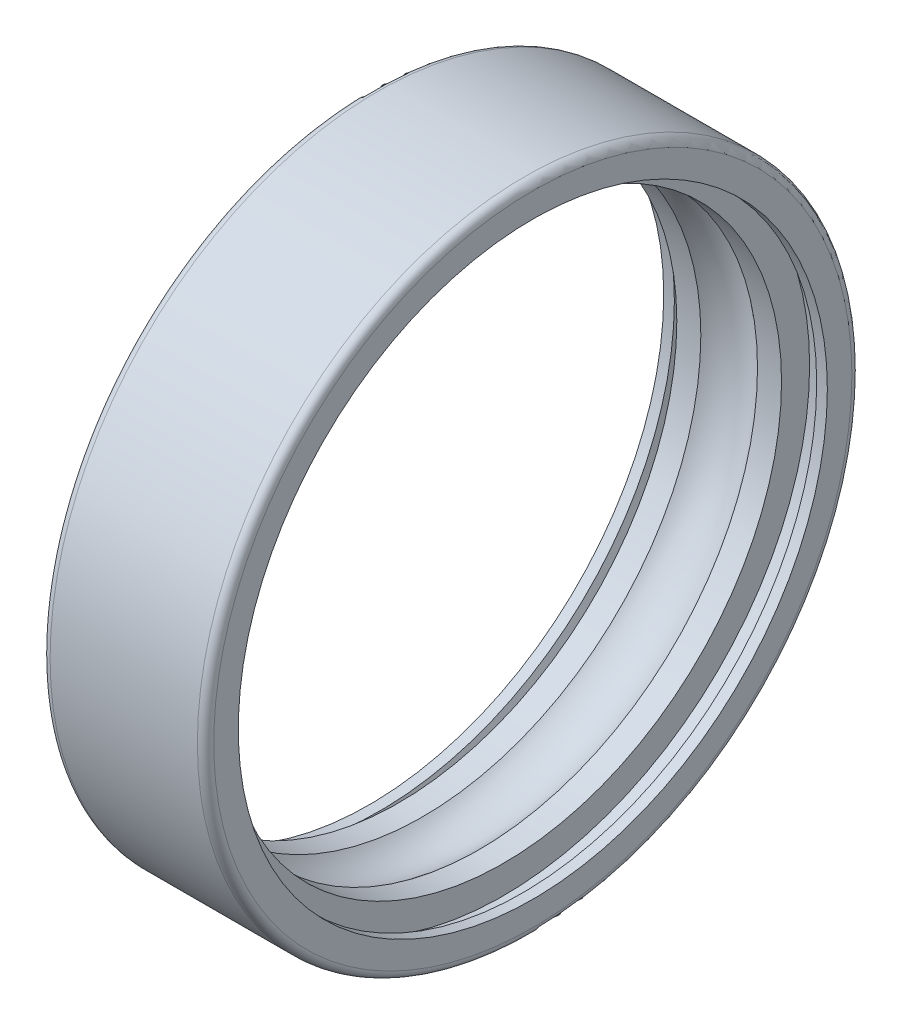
ISO-10303-21;
HEADER;
FILE_DESCRIPTION(('STEP AP214'),'2;1');
FILE_NAME('part.step','',(''),(''),'','','');
FILE_SCHEMA(('AUTOMOTIVE_DESIGN { 1 0 10303 214 1 1 1 1 }'));
ENDSEC;
DATA;
#1=APPLICATION_CONTEXT('core data for automotive mechanical design processes');
#2=APPLICATION_PROTOCOL_DEFINITION('international standard','automotive_design',2000,#1);
#3=PRODUCT_CONTEXT('',#1,'mechanical');
#4=PRODUCT('Part','Part','',(#3));
#5=PRODUCT_RELATED_PRODUCT_CATEGORY('part','',(#4));
#6=PRODUCT_DEFINITION_FORMATION('','',#4);
#7=PRODUCT_DEFINITION_CONTEXT('part definition',#1,'design');
#8=PRODUCT_DEFINITION('design','',#6,#7);
#9=PRODUCT_DEFINITION_SHAPE('','',#8);
#10=(LENGTH_UNIT() NAMED_UNIT(*) SI_UNIT(.MILLI.,.METRE.));
#11=(NAMED_UNIT(*) PLANE_ANGLE_UNIT() SI_UNIT($,.RADIAN.));
#12=(NAMED_UNIT(*) SI_UNIT($,.STERADIAN.) SOLID_ANGLE_UNIT());
#13=UNCERTAINTY_MEASURE_WITH_UNIT(LENGTH_MEASURE(1.E-05),#10,'distance_accuracy_value','');
#14=(GEOMETRIC_REPRESENTATION_CONTEXT(3) GLOBAL_UNCERTAINTY_ASSIGNED_CONTEXT((#13)) GLOBAL_UNIT_ASSIGNED_CONTEXT((#10,
#11,#12)) REPRESENTATION_CONTEXT('',''));
#15=CARTESIAN_POINT('',(0.,0.,0.));
#16=DIRECTION('',(0.,0.,1.));
#17=DIRECTION('',(1.,0.,0.));
#18=AXIS2_PLACEMENT_3D('',#15,#16,#17);
#19=CARTESIAN_POINT('',(0.,11.7,0.));
#20=DIRECTION('',(-1.,0.,0.));
#21=DIRECTION('',(0.,0.,1.));
#22=AXIS2_PLACEMENT_3D('',#19,#20,#21);
#23=PLANE('',#22);
#24=CARTESIAN_POINT('',(0.,0.,0.));
#25=DIRECTION('',(1.,0.,0.));
#26=DIRECTION('',(0.,0.,-1.));
#27=AXIS2_PLACEMENT_3D('',#24,#25,#26);
#28=CIRCLE('',#27,10.8);
#29=CARTESIAN_POINT('',(0.,0.,-10.8));
#30=VERTEX_POINT('',#29);
#31=EDGE_CURVE('E67',#30,#30,#28,.T.);
#32=ORIENTED_EDGE('',*,*,#31,.T.);
#33=EDGE_LOOP('',(#32));
#34=FACE_BOUND('',#33,.T.);
#35=CARTESIAN_POINT('',(0.,0.,0.));
#36=DIRECTION('',(1.,0.,0.));
#37=DIRECTION('',(0.,0.,-1.));
#38=AXIS2_PLACEMENT_3D('',#35,#36,#37);
#39=CIRCLE('',#38,11.7000000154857);
#40=CARTESIAN_POINT('',(0.,0.,-11.7000000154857));
#41=VERTEX_POINT('',#40);
#42=EDGE_CURVE('E64',#41,#41,#39,.T.);
#43=ORIENTED_EDGE('',*,*,#42,.F.);
#44=EDGE_LOOP('',(#43));
#45=FACE_BOUND('',#44,.T.);
#46=ADVANCED_FACE('F14',(#34,#45),#23,.T.);
#47=CARTESIAN_POINT('',(6.,0.,0.));
#48=DIRECTION('',(1.,0.,0.));
#49=DIRECTION('',(0.,0.,-1.));
#50=AXIS2_PLACEMENT_3D('',#47,#48,#49);
#51=CYLINDRICAL_SURFACE('',#50,10.8);
#52=CARTESIAN_POINT('',(0.39060981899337,0.,0.));
#53=DIRECTION('',(1.,0.,0.));
#54=DIRECTION('',(0.,0.,-1.));
#55=AXIS2_PLACEMENT_3D('',#52,#53,#54);
#56=CIRCLE('',#55,10.8);
#57=CARTESIAN_POINT('',(0.39060981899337,0.,-10.8));
#58=VERTEX_POINT('',#57);
#59=EDGE_CURVE('E61',#58,#58,#56,.T.);
#60=ORIENTED_EDGE('',*,*,#59,.T.);
#61=EDGE_LOOP('',(#60));
#62=FACE_BOUND('',#61,.T.);
#63=ORIENTED_EDGE('',*,*,#31,.F.);
#64=EDGE_LOOP('',(#63));
#65=FACE_BOUND('',#64,.T.);
#66=ADVANCED_FACE('F73',(#62,#65),#51,.F.);
#67=CARTESIAN_POINT('',(0.39060981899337,0.,0.));
#68=DIRECTION('',(1.,0.,0.));
#69=DIRECTION('',(0.,0.,-1.));
#70=AXIS2_PLACEMENT_3D('',#67,#68,#69);
#71=CONICAL_SURFACE('',#70,10.8,1.14109666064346);
#72=CARTESIAN_POINT('',(0.58747727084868,0.,0.));
#73=DIRECTION('',(1.,0.,0.));
#74=DIRECTION('',(0.,0.,-1.));
#75=AXIS2_PLACEMENT_3D('',#72,#73,#74);
#76=CIRCLE('',#75,11.2296);
#77=CARTESIAN_POINT('',(0.58747727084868,0.,-11.2296));
#78=VERTEX_POINT('',#77);
#79=EDGE_CURVE('E58',#78,#78,#76,.T.);
#80=ORIENTED_EDGE('',*,*,#79,.T.);
#81=EDGE_LOOP('',(#80));
#82=FACE_BOUND('',#81,.T.);
#83=ORIENTED_EDGE('',*,*,#59,.F.);
#84=EDGE_LOOP('',(#83));
#85=FACE_BOUND('',#84,.T.);
#86=ADVANCED_FACE('F75',(#82,#85),#71,.F.);
#87=CARTESIAN_POINT('',(6.,0.,0.));
#88=DIRECTION('',(1.,0.,0.));
#89=DIRECTION('',(0.,0.,-1.));
#90=AXIS2_PLACEMENT_3D('',#87,#88,#89);
#91=CYLINDRICAL_SURFACE('',#90,11.2296);
#92=CARTESIAN_POINT('',(1.08,0.,0.));
#93=DIRECTION('',(1.,0.,0.));
#94=DIRECTION('',(0.,0.,-1.));
#95=AXIS2_PLACEMENT_3D('',#92,#93,#94);
#96=CIRCLE('',#95,11.2296);
#97=CARTESIAN_POINT('',(1.08,0.,-11.2296));
#98=VERTEX_POINT('',#97);
#99=EDGE_CURVE('E55',#98,#98,#96,.T.);
#100=ORIENTED_EDGE('',*,*,#99,.T.);
#101=EDGE_LOOP('',(#100));
#102=FACE_BOUND('',#101,.T.);
#103=ORIENTED_EDGE('',*,*,#79,.F.);
#104=EDGE_LOOP('',(#103));
#105=FACE_BOUND('',#104,.T.);
#106=ADVANCED_FACE('F83',(#102,#105),#91,.F.);
#107=CARTESIAN_POINT('',(1.08,11.2296,0.));
#108=DIRECTION('',(-1.,0.,0.));
#109=DIRECTION('',(0.,0.,1.));
#110=AXIS2_PLACEMENT_3D('',#107,#108,#109);
#111=PLANE('',#110);
#112=CARTESIAN_POINT('',(1.08,0.,0.));
#113=DIRECTION('',(1.,0.,0.));
#114=DIRECTION('',(0.,0.,-1.));
#115=AXIS2_PLACEMENT_3D('',#112,#113,#114);
#116=CIRCLE('',#115,10.2);
#117=CARTESIAN_POINT('',(1.08,0.,-10.2));
#118=VERTEX_POINT('',#117);
#119=EDGE_CURVE('E52',#118,#118,#116,.T.);
#120=ORIENTED_EDGE('',*,*,#119,.T.);
#121=EDGE_LOOP('',(#120));
#122=FACE_BOUND('',#121,.T.);
#123=ORIENTED_EDGE('',*,*,#99,.F.);
#124=EDGE_LOOP('',(#123));
#125=FACE_BOUND('',#124,.T.);
#126=ADVANCED_FACE('F90',(#122,#125),#111,.T.);
#127=CARTESIAN_POINT('',(6.,0.,0.));
#128=DIRECTION('',(1.,0.,0.));
#129=DIRECTION('',(0.,0.,-1.));
#130=AXIS2_PLACEMENT_3D('',#127,#128,#129);
#131=CYLINDRICAL_SURFACE('',#130,10.2);
#132=CARTESIAN_POINT('',(1.9606943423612,0.,0.));
#133=DIRECTION('',(1.,0.,0.));
#134=DIRECTION('',(0.,0.,-1.));
#135=AXIS2_PLACEMENT_3D('',#132,#133,#134);
#136=CIRCLE('',#135,10.2);
#137=CARTESIAN_POINT('',(1.9606943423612,0.,-10.2));
#138=VERTEX_POINT('',#137);
#139=EDGE_CURVE('E49',#138,#138,#136,.T.);
#140=ORIENTED_EDGE('',*,*,#139,.T.);
#141=EDGE_LOOP('',(#140));
#142=FACE_BOUND('',#141,.T.);
#143=ORIENTED_EDGE('',*,*,#119,.F.);
#144=EDGE_LOOP('',(#143));
#145=FACE_BOUND('',#144,.T.);
#146=ADVANCED_FACE('F94',(#142,#145),#131,.F.);
#147=CARTESIAN_POINT('',(3.,0.,0.));
#148=DIRECTION('',(1.,0.,0.));
#149=DIRECTION('',(0.,0.,-1.));
#150=AXIS2_PLACEMENT_3D('',#147,#148,#149);
#151=TOROIDAL_SURFACE('',#150,9.,1.5875);
#152=ORIENTED_EDGE('',*,*,#139,.F.);
#153=EDGE_LOOP('',(#152));
#154=FACE_BOUND('',#153,.T.);
#155=CARTESIAN_POINT('',(4.0393056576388,0.,0.));
#156=DIRECTION('',(1.,0.,0.));
#157=DIRECTION('',(0.,0.,-1.));
#158=AXIS2_PLACEMENT_3D('',#155,#156,#157);
#159=CIRCLE('',#158,10.2);
#160=CARTESIAN_POINT('',(4.0393056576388,0.,-10.2));
#161=VERTEX_POINT('',#160);
#162=EDGE_CURVE('E46',#161,#161,#159,.T.);
#163=ORIENTED_EDGE('',*,*,#162,.T.);
#164=EDGE_LOOP('',(#163));
#165=FACE_BOUND('',#164,.T.);
#166=ADVANCED_FACE('F98',(#154,#165),#151,.F.);
#167=CARTESIAN_POINT('',(6.,0.,0.));
#168=DIRECTION('',(1.,0.,0.));
#169=DIRECTION('',(0.,0.,-1.));
#170=AXIS2_PLACEMENT_3D('',#167,#168,#169);
#171=CYLINDRICAL_SURFACE('',#170,10.2);
#172=CARTESIAN_POINT('',(4.92,0.,0.));
#173=DIRECTION('',(1.,0.,0.));
#174=DIRECTION('',(0.,0.,-1.));
#175=AXIS2_PLACEMENT_3D('',#172,#173,#174);
#176=CIRCLE('',#175,10.2);
#177=CARTESIAN_POINT('',(4.92,0.,-10.2));
#178=VERTEX_POINT('',#177);
#179=EDGE_CURVE('E43',#178,#178,#176,.T.);
#180=ORIENTED_EDGE('',*,*,#179,.T.);
#181=EDGE_LOOP('',(#180));
#182=FACE_BOUND('',#181,.T.);
#183=ORIENTED_EDGE('',*,*,#162,.F.);
#184=EDGE_LOOP('',(#183));
#185=FACE_BOUND('',#184,.T.);
#186=ADVANCED_FACE('F102',(#182,#185),#171,.F.);
#187=CARTESIAN_POINT('',(4.92,10.2,0.));
#188=DIRECTION('',(1.,0.,0.));
#189=DIRECTION('',(0.,0.,-1.));
#190=AXIS2_PLACEMENT_3D('',#187,#188,#189);
#191=PLANE('',#190);
#192=CARTESIAN_POINT('',(4.92,0.,0.));
#193=DIRECTION('',(1.,0.,0.));
#194=DIRECTION('',(0.,0.,-1.));
#195=AXIS2_PLACEMENT_3D('',#192,#193,#194);
#196=CIRCLE('',#195,11.2296);
#197=CARTESIAN_POINT('',(4.92,0.,-11.2296));
#198=VERTEX_POINT('',#197);
#199=EDGE_CURVE('E40',#198,#198,#196,.T.);
#200=ORIENTED_EDGE('',*,*,#199,.T.);
#201=EDGE_LOOP('',(#200));
#202=FACE_BOUND('',#201,.T.);
#203=ORIENTED_EDGE('',*,*,#179,.F.);
#204=EDGE_LOOP('',(#203));
#205=FACE_BOUND('',#204,.T.);
#206=ADVANCED_FACE('F106',(#202,#205),#191,.T.);
#207=CARTESIAN_POINT('',(6.,0.,0.));
#208=DIRECTION('',(1.,0.,0.));
#209=DIRECTION('',(0.,0.,-1.));
#210=AXIS2_PLACEMENT_3D('',#207,#208,#209);
#211=CYLINDRICAL_SURFACE('',#210,11.2296);
#212=CARTESIAN_POINT('',(5.4125227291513,0.,0.));
#213=DIRECTION('',(1.,0.,0.));
#214=DIRECTION('',(0.,0.,-1.));
#215=AXIS2_PLACEMENT_3D('',#212,#213,#214);
#216=CIRCLE('',#215,11.2296);
#217=CARTESIAN_POINT('',(5.4125227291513,0.,-11.2296));
#218=VERTEX_POINT('',#217);
#219=EDGE_CURVE('E37',#218,#218,#216,.T.);
#220=ORIENTED_EDGE('',*,*,#219,.T.);
#221=EDGE_LOOP('',(#220));
#222=FACE_BOUND('',#221,.T.);
#223=ORIENTED_EDGE('',*,*,#199,.F.);
#224=EDGE_LOOP('',(#223));
#225=FACE_BOUND('',#224,.T.);
#226=ADVANCED_FACE('F110',(#222,#225),#211,.F.);
#227=CARTESIAN_POINT('',(5.4125227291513,0.,0.));
#228=DIRECTION('',(-1.,0.,0.));
#229=DIRECTION('',(0.,0.,1.));
#230=AXIS2_PLACEMENT_3D('',#227,#228,#229);
#231=CONICAL_SURFACE('',#230,11.2296,1.14109666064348);
#232=CARTESIAN_POINT('',(5.6093901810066,0.,0.));
#233=DIRECTION('',(1.,0.,0.));
#234=DIRECTION('',(0.,0.,-1.));
#235=AXIS2_PLACEMENT_3D('',#232,#233,#234);
#236=CIRCLE('',#235,10.8);
#237=CARTESIAN_POINT('',(5.6093901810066,0.,-10.8));
#238=VERTEX_POINT('',#237);
#239=EDGE_CURVE('E34',#238,#238,#236,.T.);
#240=ORIENTED_EDGE('',*,*,#239,.T.);
#241=EDGE_LOOP('',(#240));
#242=FACE_BOUND('',#241,.T.);
#243=ORIENTED_EDGE('',*,*,#219,.F.);
#244=EDGE_LOOP('',(#243));
#245=FACE_BOUND('',#244,.T.);
#246=ADVANCED_FACE('F114',(#242,#245),#231,.F.);
#247=CARTESIAN_POINT('',(6.,0.,0.));
#248=DIRECTION('',(1.,0.,0.));
#249=DIRECTION('',(0.,0.,-1.));
#250=AXIS2_PLACEMENT_3D('',#247,#248,#249);
#251=CYLINDRICAL_SURFACE('',#250,10.8);
#252=CARTESIAN_POINT('',(6.,0.,0.));
#253=DIRECTION('',(1.,0.,0.));
#254=DIRECTION('',(0.,0.,-1.));
#255=AXIS2_PLACEMENT_3D('',#252,#253,#254);
#256=CIRCLE('',#255,10.8);
#257=CARTESIAN_POINT('',(6.,0.,-10.8));
#258=VERTEX_POINT('',#257);
#259=EDGE_CURVE('E29',#258,#258,#256,.T.);
#260=ORIENTED_EDGE('',*,*,#259,.T.);
#261=EDGE_LOOP('',(#260));
#262=FACE_BOUND('',#261,.T.);
#263=ORIENTED_EDGE('',*,*,#239,.F.);
#264=EDGE_LOOP('',(#263));
#265=FACE_BOUND('',#264,.T.);
#266=ADVANCED_FACE('F118',(#262,#265),#251,.F.);
#267=CARTESIAN_POINT('',(6.,10.8,0.));
#268=DIRECTION('',(1.,0.,0.));
#269=DIRECTION('',(0.,0.,-1.));
#270=AXIS2_PLACEMENT_3D('',#267,#268,#269);
#271=PLANE('',#270);
#272=CARTESIAN_POINT('',(6.,0.,0.));
#273=DIRECTION('',(1.,0.,0.));
#274=DIRECTION('',(0.,0.,-1.));
#275=AXIS2_PLACEMENT_3D('',#272,#273,#274);
#276=CIRCLE('',#275,11.6999999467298);
#277=CARTESIAN_POINT('',(6.,0.,-11.6999999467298));
#278=VERTEX_POINT('',#277);
#279=EDGE_CURVE('E25',#278,#278,#276,.T.);
#280=ORIENTED_EDGE('',*,*,#279,.T.);
#281=EDGE_LOOP('',(#280));
#282=FACE_BOUND('',#281,.T.);
#283=ORIENTED_EDGE('',*,*,#259,.F.);
#284=EDGE_LOOP('',(#283));
#285=FACE_BOUND('',#284,.T.);
#286=ADVANCED_FACE('F122',(#282,#285),#271,.T.);
#287=CARTESIAN_POINT('',(5.70000000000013,0.,0.));
#288=DIRECTION('',(1.,0.,0.));
#289=DIRECTION('',(0.,0.,-1.));
#290=AXIS2_PLACEMENT_3D('',#287,#288,#289);
#291=TOROIDAL_SURFACE('',#290,11.7000000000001,0.299999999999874);
#292=CARTESIAN_POINT('',(5.7,0.,0.));
#293=DIRECTION('',(1.,0.,0.));
#294=DIRECTION('',(0.,0.,-1.));
#295=AXIS2_PLACEMENT_3D('',#292,#293,#294);
#296=CIRCLE('',#295,12.);
#297=CARTESIAN_POINT('',(5.7,0.,-12.));
#298=VERTEX_POINT('',#297);
#299=EDGE_CURVE('E21',#298,#298,#296,.T.);
#300=ORIENTED_EDGE('',*,*,#299,.T.);
#301=EDGE_LOOP('',(#300));
#302=FACE_BOUND('',#301,.T.);
#303=ORIENTED_EDGE('',*,*,#279,.F.);
#304=EDGE_LOOP('',(#303));
#305=FACE_BOUND('',#304,.T.);
#306=ADVANCED_FACE('F126',(#302,#305),#291,.T.);
#307=CARTESIAN_POINT('',(6.,0.,0.));
#308=DIRECTION('',(1.,0.,0.));
#309=DIRECTION('',(0.,0.,-1.));
#310=AXIS2_PLACEMENT_3D('',#307,#308,#309);
#311=CYLINDRICAL_SURFACE('',#310,12.);
#312=CARTESIAN_POINT('',(0.3,0.,0.));
#313=DIRECTION('',(1.,0.,0.));
#314=DIRECTION('',(0.,0.,-1.));
#315=AXIS2_PLACEMENT_3D('',#312,#313,#314);
#316=CIRCLE('',#315,12.);
#317=CARTESIAN_POINT('',(0.3,0.,-12.));
#318=VERTEX_POINT('',#317);
#319=EDGE_CURVE('E10',#318,#318,#316,.T.);
#320=ORIENTED_EDGE('',*,*,#319,.T.);
#321=EDGE_LOOP('',(#320));
#322=FACE_BOUND('',#321,.T.);
#323=ORIENTED_EDGE('',*,*,#299,.F.);
#324=EDGE_LOOP('',(#323));
#325=FACE_BOUND('',#324,.T.);
#326=ADVANCED_FACE('F129',(#322,#325),#311,.T.);
#327=CARTESIAN_POINT('',(0.299999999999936,0.,0.));
#328=DIRECTION('',(1.,0.,0.));
#329=DIRECTION('',(0.,0.,-1.));
#330=AXIS2_PLACEMENT_3D('',#327,#328,#329);
#331=TOROIDAL_SURFACE('',#330,11.7,0.299999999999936);
#332=ORIENTED_EDGE('',*,*,#42,.T.);
#333=EDGE_LOOP('',(#332));
#334=FACE_BOUND('',#333,.T.);
#335=ORIENTED_EDGE('',*,*,#319,.F.);
#336=EDGE_LOOP('',(#335));
#337=FACE_BOUND('',#336,.T.);
#338=ADVANCED_FACE('F16',(#334,#337),#331,.T.);
#339=CLOSED_SHELL('',(#46,#66,#86,#106,#126,#146,#166,#186,#206,#226,#246,#266,#286,#306,#326,#338));
#340=MANIFOLD_SOLID_BREP('B1',#339);
#341=ADVANCED_BREP_SHAPE_REPRESENTATION('',(#18,#340),#14);
#342=SHAPE_DEFINITION_REPRESENTATION(#9,#341);
ENDSEC;
END-ISO-10303-21;
